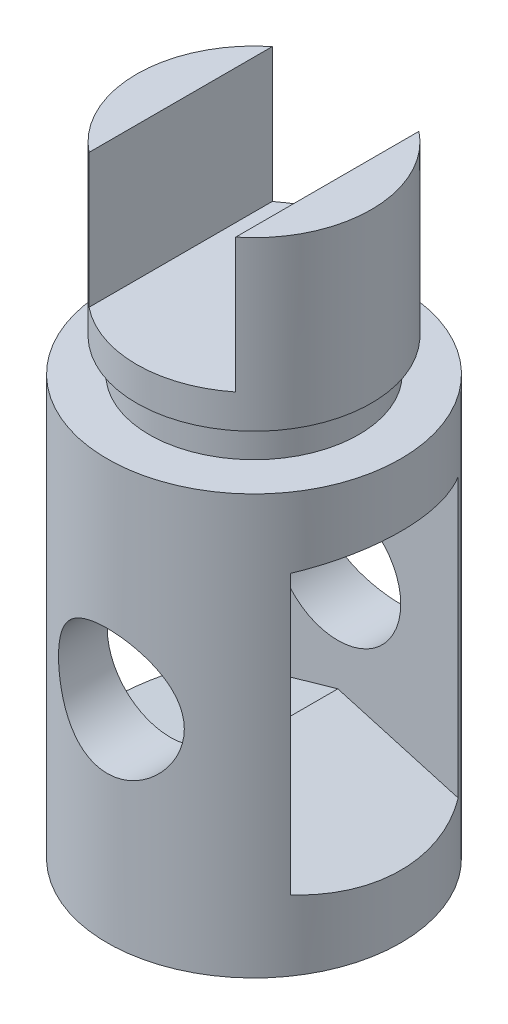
ISO-10303-21;
HEADER;
FILE_DESCRIPTION(('STEP AP214'),'2;1');
FILE_NAME('part.step','',(''),(''),'','','');
FILE_SCHEMA(('AUTOMOTIVE_DESIGN { 1 0 10303 214 1 1 1 1 }'));
ENDSEC;
DATA;
#1=APPLICATION_CONTEXT('core data for automotive mechanical design processes');
#2=APPLICATION_PROTOCOL_DEFINITION('international standard','automotive_design',2000,#1);
#3=PRODUCT_CONTEXT('',#1,'mechanical');
#4=PRODUCT('Part','Part','',(#3));
#5=PRODUCT_RELATED_PRODUCT_CATEGORY('part','',(#4));
#6=PRODUCT_DEFINITION_FORMATION('','',#4);
#7=PRODUCT_DEFINITION_CONTEXT('part definition',#1,'design');
#8=PRODUCT_DEFINITION('design','',#6,#7);
#9=PRODUCT_DEFINITION_SHAPE('','',#8);
#10=(LENGTH_UNIT() NAMED_UNIT(*) SI_UNIT(.MILLI.,.METRE.));
#11=(NAMED_UNIT(*) PLANE_ANGLE_UNIT() SI_UNIT($,.RADIAN.));
#12=(NAMED_UNIT(*) SI_UNIT($,.STERADIAN.) SOLID_ANGLE_UNIT());
#13=UNCERTAINTY_MEASURE_WITH_UNIT(LENGTH_MEASURE(1.E-05),#10,'distance_accuracy_value','');
#14=(GEOMETRIC_REPRESENTATION_CONTEXT(3) GLOBAL_UNCERTAINTY_ASSIGNED_CONTEXT((#13)) GLOBAL_UNIT_ASSIGNED_CONTEXT((#10,
#11,#12)) REPRESENTATION_CONTEXT('',''));
#15=CARTESIAN_POINT('',(0.,0.,0.));
#16=DIRECTION('',(0.,0.,1.));
#17=DIRECTION('',(1.,0.,0.));
#18=AXIS2_PLACEMENT_3D('',#15,#16,#17);
#19=CARTESIAN_POINT('',(-28.,98.,0.));
#20=DIRECTION('',(0.,1.,0.));
#21=DIRECTION('',(-1.,0.,0.));
#22=AXIS2_PLACEMENT_3D('',#19,#20,#21);
#23=PLANE('',#22);
#24=DIRECTION('',(0.,0.,1.));
#25=VECTOR('',#24,1.);
#26=CARTESIAN_POINT('',(-17.5,98.,0.));
#27=LINE('',#26,#25);
#28=CARTESIAN_POINT('',(-17.5,98.,-21.8574929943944));
#29=VERTEX_POINT('',#28);
#30=CARTESIAN_POINT('',(-17.5,98.,21.8574929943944));
#31=VERTEX_POINT('',#30);
#32=EDGE_CURVE('E114',#29,#31,#27,.T.);
#33=ORIENTED_EDGE('',*,*,#32,.F.);
#34=CARTESIAN_POINT('',(0.,98.,0.));
#35=DIRECTION('',(0.,1.,0.));
#36=DIRECTION('',(-1.,0.,0.));
#37=AXIS2_PLACEMENT_3D('',#34,#35,#36);
#38=CIRCLE('',#37,28.);
#39=EDGE_CURVE('E126',#29,#31,#38,.T.);
#40=ORIENTED_EDGE('',*,*,#39,.T.);
#41=EDGE_LOOP('',(#33,#40));
#42=FACE_BOUND('',#41,.T.);
#43=ADVANCED_FACE('F31',(#42),#23,.T.);
#44=CARTESIAN_POINT('',(0.,-50.,0.));
#45=DIRECTION('',(0.,-1.,0.));
#46=DIRECTION('',(1.,0.,0.));
#47=AXIS2_PLACEMENT_3D('',#44,#45,#46);
#48=PLANE('',#47);
#49=CARTESIAN_POINT('',(0.,-50.,0.));
#50=DIRECTION('',(0.,1.,0.));
#51=DIRECTION('',(-1.,0.,0.));
#52=AXIS2_PLACEMENT_3D('',#49,#50,#51);
#53=CIRCLE('',#52,35.);
#54=CARTESIAN_POINT('',(-35.,-50.,0.));
#55=VERTEX_POINT('',#54);
#56=EDGE_CURVE('E145',#55,#55,#53,.T.);
#57=ORIENTED_EDGE('',*,*,#56,.F.);
#58=EDGE_LOOP('',(#57));
#59=FACE_BOUND('',#58,.T.);
#60=ADVANCED_FACE('F33',(#59),#48,.T.);
#61=CARTESIAN_POINT('',(0.,98.,0.));
#62=DIRECTION('',(0.,1.,0.));
#63=DIRECTION('',(-1.,0.,0.));
#64=AXIS2_PLACEMENT_3D('',#61,#62,#63);
#65=CYLINDRICAL_SURFACE('',#64,35.);
#66=CARTESIAN_POINT('',(15.,0.,-31.6227766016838));
#67=CARTESIAN_POINT('',(14.9999969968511,-0.399001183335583,-31.6227798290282));
#68=CARTESIAN_POINT('',(14.9840568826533,-0.798130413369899,-31.6303543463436));
#69=CARTESIAN_POINT('',(14.9204623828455,-1.59346479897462,-31.660401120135));
#70=CARTESIAN_POINT('',(14.8727880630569,-1.98966795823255,-31.6828827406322));
#71=CARTESIAN_POINT('',(14.7461180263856,-2.77692441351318,-31.7420366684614));
#72=CARTESIAN_POINT('',(14.667048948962,-3.16796341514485,-31.7787422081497));
#73=CARTESIAN_POINT('',(14.47847300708,-3.94108363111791,-31.8650992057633));
#74=CARTESIAN_POINT('',(14.3689706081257,-4.3231661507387,-31.9147487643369));
#75=CARTESIAN_POINT('',(14.121142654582,-5.07435740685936,-32.025171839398));
#76=CARTESIAN_POINT('',(13.9829413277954,-5.44351429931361,-32.0858972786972));
#77=CARTESIAN_POINT('',(13.6786452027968,-6.16840331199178,-32.2167980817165));
#78=CARTESIAN_POINT('',(13.5125494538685,-6.52413497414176,-32.2869737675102));
#79=CARTESIAN_POINT('',(13.1538283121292,-7.22011098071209,-32.4347713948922));
#80=CARTESIAN_POINT('',(12.9612152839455,-7.56036244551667,-32.5123898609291));
#81=CARTESIAN_POINT('',(12.5506225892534,-8.22400096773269,-32.6730849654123));
#82=CARTESIAN_POINT('',(12.332633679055,-8.5473818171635,-32.7561635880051));
#83=CARTESIAN_POINT('',(11.8588991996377,-9.1943845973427,-32.9307449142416));
#84=CARTESIAN_POINT('',(11.6016771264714,-9.51687044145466,-33.022454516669));
#85=CARTESIAN_POINT('',(11.0617742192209,-10.1393747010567,-33.2072063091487));
#86=CARTESIAN_POINT('',(10.779092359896,-10.4393922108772,-33.3002485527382));
#87=CARTESIAN_POINT('',(10.189656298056,-11.0154808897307,-33.4853156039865));
#88=CARTESIAN_POINT('',(9.88288867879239,-11.2915385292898,-33.5773398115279));
#89=CARTESIAN_POINT('',(9.24715861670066,-11.8177948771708,-33.7579502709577));
#90=CARTESIAN_POINT('',(8.91820384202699,-12.0680024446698,-33.846537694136));
#91=CARTESIAN_POINT('',(8.22390793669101,-12.5520782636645,-34.0220726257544));
#92=CARTESIAN_POINT('',(7.85758519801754,-12.7846393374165,-34.1087507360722));
#93=CARTESIAN_POINT('',(7.10466659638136,-13.2178801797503,-34.2734912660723));
#94=CARTESIAN_POINT('',(6.71806992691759,-13.4185586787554,-34.3515533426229));
#95=CARTESIAN_POINT('',(5.9273163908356,-13.7861138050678,-34.4967887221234));
#96=CARTESIAN_POINT('',(5.5231659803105,-13.9530027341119,-34.5639659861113));
#97=CARTESIAN_POINT('',(4.70011703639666,-14.2513317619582,-34.6854707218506));
#98=CARTESIAN_POINT('',(4.28121960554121,-14.3827745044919,-34.739799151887));
#99=CARTESIAN_POINT('',(3.45520660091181,-14.60253703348,-34.8313748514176));
#100=CARTESIAN_POINT('',(3.04869879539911,-14.6928213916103,-34.8693935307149));
#101=CARTESIAN_POINT('',(2.22853652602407,-14.8393777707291,-34.9314000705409));
#102=CARTESIAN_POINT('',(1.8148823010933,-14.8956509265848,-34.9553883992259));
#103=CARTESIAN_POINT('',(0.983884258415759,-14.9735121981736,-34.9886385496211));
#104=CARTESIAN_POINT('',(0.566541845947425,-14.9951129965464,-34.9979057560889));
#105=CARTESIAN_POINT('',(-0.268545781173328,-15.0034069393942,-35.0014599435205));
#106=CARTESIAN_POINT('',(-0.686290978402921,-14.9901015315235,-34.9957475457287));
#107=CARTESIAN_POINT('',(-1.49190758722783,-14.9307301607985,-34.9703596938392));
#108=CARTESIAN_POINT('',(-1.87997004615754,-14.8868295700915,-34.9516073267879));
#109=CARTESIAN_POINT('',(-2.65068752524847,-14.7690828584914,-34.9016183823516));
#110=CARTESIAN_POINT('',(-3.03334282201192,-14.6952382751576,-34.8703824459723));
#111=CARTESIAN_POINT('',(-3.79067999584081,-14.5183324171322,-34.7962000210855));
#112=CARTESIAN_POINT('',(-4.16536159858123,-14.4152701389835,-34.7532531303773));
#113=CARTESIAN_POINT('',(-4.90436245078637,-14.180885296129,-34.656689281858));
#114=CARTESIAN_POINT('',(-5.26868138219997,-14.0495618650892,-34.6030719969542));
#115=CARTESIAN_POINT('',(-5.99025205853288,-13.7575676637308,-34.4855410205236));
#116=CARTESIAN_POINT('',(-6.34731135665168,-13.5964799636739,-34.4214828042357));
#117=CARTESIAN_POINT('',(-7.04650073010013,-13.2476217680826,-34.2851820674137));
#118=CARTESIAN_POINT('',(-7.38863077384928,-13.0598512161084,-34.212939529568));
#119=CARTESIAN_POINT('',(-8.05621899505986,-12.6589476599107,-34.0619212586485));
#120=CARTESIAN_POINT('',(-8.38167533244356,-12.4458118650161,-33.9831448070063));
#121=CARTESIAN_POINT('',(-9.01440333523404,-11.9954738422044,-33.8208111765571));
#122=CARTESIAN_POINT('',(-9.32166787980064,-11.7582622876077,-33.7372521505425));
#123=CARTESIAN_POINT('',(-9.93840787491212,-11.2428311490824,-33.5609647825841));
#124=CARTESIAN_POINT('',(-10.2463720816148,-10.9628770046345,-33.4680149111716));
#125=CARTESIAN_POINT('',(-10.8378576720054,-10.3785206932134,-33.2811817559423));
#126=CARTESIAN_POINT('',(-11.1213782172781,-10.0741176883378,-33.1872984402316));
#127=CARTESIAN_POINT('',(-11.6624805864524,-9.4424336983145,-33.0010372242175));
#128=CARTESIAN_POINT('',(-11.9200531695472,-9.11514463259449,-32.9086598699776));
#129=CARTESIAN_POINT('',(-12.4076070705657,-8.43948288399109,-32.7279529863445));
#130=CARTESIAN_POINT('',(-12.6375841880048,-8.09110700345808,-32.6396240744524));
#131=CARTESIAN_POINT('',(-13.0762496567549,-7.36201511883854,-32.4664341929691));
#132=CARTESIAN_POINT('',(-13.2838446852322,-6.98058105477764,-32.3818200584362));
#133=CARTESIAN_POINT('',(-13.6657796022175,-6.19962193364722,-32.2224967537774));
#134=CARTESIAN_POINT('',(-13.840134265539,-5.80010501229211,-32.1477831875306));
#135=CARTESIAN_POINT('',(-14.1539223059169,-4.98566323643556,-32.0108701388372));
#136=CARTESIAN_POINT('',(-14.2933691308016,-4.57074438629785,-31.9486658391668));
#137=CARTESIAN_POINT('',(-14.53583039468,-3.72848779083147,-31.8390857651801));
#138=CARTESIAN_POINT('',(-14.6388483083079,-3.30115123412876,-31.7917085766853));
#139=CARTESIAN_POINT('',(-14.8014667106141,-2.46675388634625,-31.7163058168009));
#140=CARTESIAN_POINT('',(-14.8635274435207,-2.06027019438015,-31.6871903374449));
#141=CARTESIAN_POINT('',(-14.9540838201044,-1.24276757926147,-31.6445557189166));
#142=CARTESIAN_POINT('',(-14.9825809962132,-0.831748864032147,-31.6310358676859));
#143=CARTESIAN_POINT('',(-15.0056445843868,-0.00868348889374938,-31.620101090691));
#144=CARTESIAN_POINT('',(-15.0002221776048,0.403362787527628,-31.6226808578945));
#145=CARTESIAN_POINT('',(-14.9555420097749,1.22519238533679,-31.6438362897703));
#146=CARTESIAN_POINT('',(-14.9162853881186,1.634975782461,-31.6624114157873));
#147=CARTESIAN_POINT('',(-14.8083348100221,2.42060869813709,-31.7130331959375));
#148=CARTESIAN_POINT('',(-14.7418793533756,2.7968352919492,-31.7440524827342));
#149=CARTESIAN_POINT('',(-14.5808056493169,3.54194568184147,-31.8183589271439));
#150=CARTESIAN_POINT('',(-14.486188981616,3.91082988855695,-31.8616453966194));
#151=CARTESIAN_POINT('',(-14.2696869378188,4.63900052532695,-31.9591944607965));
#152=CARTESIAN_POINT('',(-14.1478014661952,4.99828692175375,-32.0134570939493));
#153=CARTESIAN_POINT('',(-13.8777487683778,5.70538226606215,-32.1314455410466));
#154=CARTESIAN_POINT('',(-13.7295712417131,6.05318665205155,-32.1951750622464));
#155=CARTESIAN_POINT('',(-13.4011569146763,6.75008844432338,-32.3332965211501));
#156=CARTESIAN_POINT('',(-13.2198147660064,7.09859720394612,-32.4080293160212));
#157=CARTESIAN_POINT('',(-12.8310033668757,7.7794024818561,-32.563925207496));
#158=CARTESIAN_POINT('',(-12.6235226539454,8.11169179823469,-32.6450911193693));
#159=CARTESIAN_POINT('',(-12.183761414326,8.7583602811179,-32.811754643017));
#160=CARTESIAN_POINT('',(-11.9514768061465,9.07273648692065,-32.8972529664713));
#161=CARTESIAN_POINT('',(-11.4634289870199,9.68205454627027,-33.0704829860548));
#162=CARTESIAN_POINT('',(-11.2076646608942,9.97699547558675,-33.1582147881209));
#163=CARTESIAN_POINT('',(-10.6506249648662,10.5709079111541,-33.3415278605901));
#164=CARTESIAN_POINT('',(-10.3473256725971,10.8679799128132,-33.4371252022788));
#165=CARTESIAN_POINT('',(-9.71633909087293,11.4355928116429,-33.6259000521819));
#166=CARTESIAN_POINT('',(-9.38865995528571,11.706142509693,-33.7190783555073));
#167=CARTESIAN_POINT('',(-8.71053874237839,12.2191371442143,-33.9005859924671));
#168=CARTESIAN_POINT('',(-8.36008927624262,12.4615728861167,-33.9889137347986));
#169=CARTESIAN_POINT('',(-7.6385557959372,12.9164364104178,-34.1583045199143));
#170=CARTESIAN_POINT('',(-7.26747222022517,13.1288648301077,-34.2393677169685));
#171=CARTESIAN_POINT('',(-6.50504044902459,13.5229249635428,-34.392388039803));
#172=CARTESIAN_POINT('',(-6.11360008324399,13.7043971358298,-34.4642975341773));
#173=CARTESIAN_POINT('',(-5.31481805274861,14.0335057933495,-34.5964819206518));
#174=CARTESIAN_POINT('',(-4.90747616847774,14.1811418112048,-34.6567566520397));
#175=CARTESIAN_POINT('',(-4.0801280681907,14.4409295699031,-34.7638668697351));
#176=CARTESIAN_POINT('',(-3.66012856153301,14.5530997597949,-34.8107093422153));
#177=CARTESIAN_POINT('',(-2.81065056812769,14.7407394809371,-34.8895705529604));
#178=CARTESIAN_POINT('',(-2.38117284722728,14.8162119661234,-34.9215904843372));
#179=CARTESIAN_POINT('',(-1.54810458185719,14.9253716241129,-34.9680494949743));
#180=CARTESIAN_POINT('',(-1.14492225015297,14.9617146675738,-34.9836045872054));
#181=CARTESIAN_POINT('',(-0.336650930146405,15.0016786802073,-35.0007146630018));
#182=CARTESIAN_POINT('',(0.0684379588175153,15.0053013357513,-35.0022703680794));
#183=CARTESIAN_POINT('',(0.877316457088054,14.9797874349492,-34.9913404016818));
#184=CARTESIAN_POINT('',(1.28110627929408,14.9506565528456,-34.9788571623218));
#185=CARTESIAN_POINT('',(2.08435932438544,14.8599731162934,-34.9401934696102));
#186=CARTESIAN_POINT('',(2.48382258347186,14.7984208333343,-34.9140131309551));
#187=CARTESIAN_POINT('',(3.25990951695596,14.6466091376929,-34.8499444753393));
#188=CARTESIAN_POINT('',(3.63681443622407,14.5575705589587,-34.812555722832));
#189=CARTESIAN_POINT('',(4.38142946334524,14.3510400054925,-34.7266976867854));
#190=CARTESIAN_POINT('',(4.74913989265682,14.2335490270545,-34.6782287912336));
#191=CARTESIAN_POINT('',(5.47318347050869,13.9711332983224,-34.5713495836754));
#192=CARTESIAN_POINT('',(5.82951524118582,13.8262052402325,-34.5129380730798));
#193=CARTESIAN_POINT('',(6.52876162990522,13.5100891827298,-34.3875190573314));
#194=CARTESIAN_POINT('',(6.87167568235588,13.3389000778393,-34.3205111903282));
#195=CARTESIAN_POINT('',(7.55759351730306,12.9631244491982,-34.1761780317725));
#196=CARTESIAN_POINT('',(7.89988828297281,12.7573709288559,-34.0985215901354));
#197=CARTESIAN_POINT('',(8.56603740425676,12.3199752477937,-33.9373019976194));
#198=CARTESIAN_POINT('',(8.88989132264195,12.0883324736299,-33.8537387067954));
#199=CARTESIAN_POINT('',(9.51757199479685,11.6005951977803,-33.6826610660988));
#200=CARTESIAN_POINT('',(9.82139648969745,11.3444979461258,-33.5951462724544));
#201=CARTESIAN_POINT('',(10.4076237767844,10.8092091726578,-33.4181862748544));
#202=CARTESIAN_POINT('',(10.690016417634,10.5300068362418,-33.3287401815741));
#203=CARTESIAN_POINT('',(11.2515403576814,9.92895006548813,-33.1435737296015));
#204=CARTESIAN_POINT('',(11.5289405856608,9.60547042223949,-33.0478701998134));
#205=CARTESIAN_POINT('',(12.0554848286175,8.93569669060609,-32.8594501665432));
#206=CARTESIAN_POINT('',(12.3046407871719,8.58941234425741,-32.7667324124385));
#207=CARTESIAN_POINT('',(12.7733627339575,7.87551217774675,-32.586872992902));
#208=CARTESIAN_POINT('',(12.9929022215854,7.50787766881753,-32.4997363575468));
#209=CARTESIAN_POINT('',(13.4004122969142,6.75371231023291,-32.3338425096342));
#210=CARTESIAN_POINT('',(13.5883850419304,6.36718275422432,-32.2550847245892));
#211=CARTESIAN_POINT('',(13.9307889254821,5.57832120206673,-32.1086866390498));
#212=CARTESIAN_POINT('',(14.0852785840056,5.17601825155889,-32.0410269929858));
#213=CARTESIAN_POINT('',(14.3595587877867,4.35767079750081,-31.9190482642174));
#214=CARTESIAN_POINT('',(14.4793432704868,3.9416239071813,-31.8647315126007));
#215=CARTESIAN_POINT('',(14.6824564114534,3.10035314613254,-31.7716530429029));
#216=CARTESIAN_POINT('',(14.7658930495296,2.67516044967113,-31.7328452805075));
#217=CARTESIAN_POINT('',(14.8956958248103,1.81818415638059,-31.6721241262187));
#218=CARTESIAN_POINT('',(14.9420903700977,1.38640586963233,-31.6501977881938));
#219=CARTESIAN_POINT('',(14.9797789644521,0.794693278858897,-31.6323614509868));
#220=CARTESIAN_POINT('',(14.9873593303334,0.635879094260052,-31.6287699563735));
#221=CARTESIAN_POINT('',(14.9974704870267,0.318050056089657,-31.6239768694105));
#222=CARTESIAN_POINT('',(15.0000011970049,0.159035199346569,-31.6227753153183));
#223=CARTESIAN_POINT('',(15.,0.,-31.6227766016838));
#224=B_SPLINE_CURVE_WITH_KNOTS('',3,(#66,#67,#68,#69,#70,#71,#72,#73,#74,#75,#76,#77,#78,#79,
#80,#81,#82,#83,#84,#85,#86,#87,#88,#89,#90,#91,#92,#93,#94,#95,#96,#97,#98,#99,#100,#101,#102,
#103,#104,#105,#106,#107,#108,#109,#110,#111,#112,#113,#114,#115,#116,#117,#118,#119,#120,#121,
#122,#123,#124,#125,#126,#127,#128,#129,#130,#131,#132,#133,#134,#135,#136,#137,#138,#139,#140,
#141,#142,#143,#144,#145,#146,#147,#148,#149,#150,#151,#152,#153,#154,#155,#156,#157,#158,#159,
#160,#161,#162,#163,#164,#165,#166,#167,#168,#169,#170,#171,#172,#173,#174,#175,#176,#177,#178,
#179,#180,#181,#182,#183,#184,#185,#186,#187,#188,#189,#190,#191,#192,#193,#194,#195,#196,#197,
#198,#199,#200,#201,#202,#203,#204,#205,#206,#207,#208,#209,#210,#211,#212,#213,#214,#215,#216,
#217,#218,#219,#220,#221,#222,#223),.UNSPECIFIED.,.T.,.F.,(4,2,2,2,2,2,2,2,2,2,2,2,2,2,2,2,2,2,
2,2,2,2,2,2,2,2,2,2,2,2,2,2,2,2,2,2,2,2,2,2,2,2,2,2,2,2,2,2,2,2,2,2,2,2,2,2,2,2,2,2,2,2,2,2,2,2,
2,2,2,2,2,2,2,2,2,2,2,2,4),(0.,1.1968382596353,2.39442903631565,3.59483486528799,
4.79506465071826,5.99020348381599,7.18538305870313,8.38000721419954,9.57506790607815,
10.8414089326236,12.1078009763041,13.3749035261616,14.6415703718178,15.9673413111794,
17.2931650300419,18.6185051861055,19.9437464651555,21.1965415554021,22.4492948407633,
23.7015897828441,24.9538327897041,26.1254164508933,27.2969399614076,28.4685037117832,
29.6401033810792,30.82956641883,32.0190319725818,33.2086285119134,34.3986876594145,
35.6765982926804,36.9545527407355,38.2329607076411,39.5115630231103,40.8371660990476,
42.1621785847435,43.4866798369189,44.8110547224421,46.0460817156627,47.2810523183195,
48.5156158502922,49.7501378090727,50.8987548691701,52.0473075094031,53.1958641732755,
54.3448718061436,55.5433331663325,56.7423219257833,57.9415082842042,59.1407516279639,
60.4447784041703,61.7483709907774,63.0523887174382,64.3563787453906,65.6668985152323,
66.9774363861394,68.2872913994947,69.5970409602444,70.8108492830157,72.0245950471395,
73.238130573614,74.4516559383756,75.6175774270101,76.783458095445,77.949479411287,
79.1155498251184,80.33479554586,81.5540701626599,82.7734820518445,83.9934679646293,
85.3021866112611,86.6103497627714,87.9196757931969,89.228912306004,90.5358418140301,
91.8429994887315,93.146247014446,94.4484940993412,94.9255261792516,95.4025658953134),.UNSPECIFIED.);
#225=CARTESIAN_POINT('',(15.,0.,-31.6227766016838));
#226=VERTEX_POINT('',#225);
#227=EDGE_CURVE('E195',#226,#226,#224,.T.);
#228=ORIENTED_EDGE('',*,*,#227,.F.);
#229=EDGE_LOOP('',(#228));
#230=FACE_BOUND('',#229,.T.);
#231=CARTESIAN_POINT('',(15.,0.,31.6227766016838));
#232=CARTESIAN_POINT('',(14.9999969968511,0.399001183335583,31.6227798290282));
#233=CARTESIAN_POINT('',(14.9840568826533,0.798130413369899,31.6303543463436));
#234=CARTESIAN_POINT('',(14.9204623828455,1.59346479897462,31.660401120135));
#235=CARTESIAN_POINT('',(14.8727880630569,1.98966795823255,31.6828827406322));
#236=CARTESIAN_POINT('',(14.7461180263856,2.77692441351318,31.7420366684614));
#237=CARTESIAN_POINT('',(14.667048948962,3.16796341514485,31.7787422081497));
#238=CARTESIAN_POINT('',(14.47847300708,3.94108363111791,31.8650992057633));
#239=CARTESIAN_POINT('',(14.3689706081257,4.3231661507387,31.9147487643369));
#240=CARTESIAN_POINT('',(14.121142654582,5.07435740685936,32.025171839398));
#241=CARTESIAN_POINT('',(13.9829413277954,5.44351429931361,32.0858972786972));
#242=CARTESIAN_POINT('',(13.6786452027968,6.16840331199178,32.2167980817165));
#243=CARTESIAN_POINT('',(13.5125494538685,6.52413497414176,32.2869737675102));
#244=CARTESIAN_POINT('',(13.1538283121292,7.22011098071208,32.4347713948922));
#245=CARTESIAN_POINT('',(12.9612152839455,7.56036244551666,32.5123898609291));
#246=CARTESIAN_POINT('',(12.5506225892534,8.22400096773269,32.6730849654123));
#247=CARTESIAN_POINT('',(12.332633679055,8.5473818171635,32.7561635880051));
#248=CARTESIAN_POINT('',(11.8588991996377,9.1943845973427,32.9307449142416));
#249=CARTESIAN_POINT('',(11.6016771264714,9.51687044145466,33.022454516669));
#250=CARTESIAN_POINT('',(11.0617742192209,10.1393747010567,33.2072063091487));
#251=CARTESIAN_POINT('',(10.779092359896,10.4393922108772,33.3002485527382));
#252=CARTESIAN_POINT('',(10.189656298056,11.0154808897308,33.4853156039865));
#253=CARTESIAN_POINT('',(9.88288867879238,11.2915385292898,33.5773398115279));
#254=CARTESIAN_POINT('',(9.24715861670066,11.8177948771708,33.7579502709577));
#255=CARTESIAN_POINT('',(8.91820384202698,12.0680024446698,33.846537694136));
#256=CARTESIAN_POINT('',(8.22390793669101,12.5520782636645,34.0220726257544));
#257=CARTESIAN_POINT('',(7.85758519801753,12.7846393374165,34.1087507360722));
#258=CARTESIAN_POINT('',(7.10466659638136,13.2178801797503,34.2734912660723));
#259=CARTESIAN_POINT('',(6.71806992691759,13.4185586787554,34.3515533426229));
#260=CARTESIAN_POINT('',(5.9273163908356,13.7861138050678,34.4967887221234));
#261=CARTESIAN_POINT('',(5.5231659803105,13.9530027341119,34.5639659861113));
#262=CARTESIAN_POINT('',(4.70011703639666,14.2513317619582,34.6854707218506));
#263=CARTESIAN_POINT('',(4.2812196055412,14.3827745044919,34.739799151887));
#264=CARTESIAN_POINT('',(3.45520660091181,14.60253703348,34.8313748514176));
#265=CARTESIAN_POINT('',(3.04869879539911,14.6928213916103,34.8693935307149));
#266=CARTESIAN_POINT('',(2.22853652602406,14.8393777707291,34.9314000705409));
#267=CARTESIAN_POINT('',(1.8148823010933,14.8956509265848,34.9553883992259));
#268=CARTESIAN_POINT('',(0.983884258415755,14.9735121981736,34.9886385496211));
#269=CARTESIAN_POINT('',(0.56654184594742,14.9951129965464,34.9979057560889));
#270=CARTESIAN_POINT('',(-0.268545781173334,15.0034069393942,35.0014599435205));
#271=CARTESIAN_POINT('',(-0.686290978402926,14.9901015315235,34.9957475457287));
#272=CARTESIAN_POINT('',(-1.49190758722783,14.9307301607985,34.9703596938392));
#273=CARTESIAN_POINT('',(-1.87997004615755,14.8868295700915,34.9516073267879));
#274=CARTESIAN_POINT('',(-2.65068752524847,14.7690828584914,34.9016183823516));
#275=CARTESIAN_POINT('',(-3.03334282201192,14.6952382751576,34.8703824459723));
#276=CARTESIAN_POINT('',(-3.79067999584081,14.5183324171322,34.7962000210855));
#277=CARTESIAN_POINT('',(-4.16536159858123,14.4152701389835,34.7532531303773));
#278=CARTESIAN_POINT('',(-4.90436245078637,14.180885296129,34.656689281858));
#279=CARTESIAN_POINT('',(-5.26868138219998,14.0495618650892,34.6030719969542));
#280=CARTESIAN_POINT('',(-5.99025205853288,13.7575676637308,34.4855410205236));
#281=CARTESIAN_POINT('',(-6.34731135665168,13.5964799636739,34.4214828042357));
#282=CARTESIAN_POINT('',(-7.04650073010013,13.2476217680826,34.2851820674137));
#283=CARTESIAN_POINT('',(-7.38863077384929,13.0598512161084,34.212939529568));
#284=CARTESIAN_POINT('',(-8.05621899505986,12.6589476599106,34.0619212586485));
#285=CARTESIAN_POINT('',(-8.38167533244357,12.4458118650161,33.9831448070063));
#286=CARTESIAN_POINT('',(-9.01440333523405,11.9954738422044,33.8208111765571));
#287=CARTESIAN_POINT('',(-9.32166787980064,11.7582622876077,33.7372521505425));
#288=CARTESIAN_POINT('',(-9.93840787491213,11.2428311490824,33.5609647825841));
#289=CARTESIAN_POINT('',(-10.2463720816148,10.9628770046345,33.4680149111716));
#290=CARTESIAN_POINT('',(-10.8378576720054,10.3785206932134,33.2811817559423));
#291=CARTESIAN_POINT('',(-11.1213782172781,10.0741176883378,33.1872984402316));
#292=CARTESIAN_POINT('',(-11.6624805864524,9.44243369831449,33.0010372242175));
#293=CARTESIAN_POINT('',(-11.9200531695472,9.11514463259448,32.9086598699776));
#294=CARTESIAN_POINT('',(-12.4076070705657,8.43948288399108,32.7279529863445));
#295=CARTESIAN_POINT('',(-12.6375841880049,8.09110700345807,32.6396240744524));
#296=CARTESIAN_POINT('',(-13.0762496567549,7.36201511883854,32.4664341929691));
#297=CARTESIAN_POINT('',(-13.2838446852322,6.98058105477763,32.3818200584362));
#298=CARTESIAN_POINT('',(-13.6657796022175,6.19962193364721,32.2224967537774));
#299=CARTESIAN_POINT('',(-13.840134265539,5.80010501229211,32.1477831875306));
#300=CARTESIAN_POINT('',(-14.1539223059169,4.98566323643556,32.0108701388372));
#301=CARTESIAN_POINT('',(-14.2933691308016,4.57074438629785,31.9486658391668));
#302=CARTESIAN_POINT('',(-14.53583039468,3.72848779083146,31.8390857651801));
#303=CARTESIAN_POINT('',(-14.6388483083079,3.30115123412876,31.7917085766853));
#304=CARTESIAN_POINT('',(-14.8014667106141,2.46675388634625,31.7163058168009));
#305=CARTESIAN_POINT('',(-14.8635274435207,2.06027019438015,31.6871903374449));
#306=CARTESIAN_POINT('',(-14.9540838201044,1.24276757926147,31.6445557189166));
#307=CARTESIAN_POINT('',(-14.9825809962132,0.831748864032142,31.6310358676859));
#308=CARTESIAN_POINT('',(-15.0056445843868,0.00868348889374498,31.620101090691));
#309=CARTESIAN_POINT('',(-15.0002221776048,-0.403362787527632,31.6226808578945));
#310=CARTESIAN_POINT('',(-14.9555420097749,-1.2251923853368,31.6438362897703));
#311=CARTESIAN_POINT('',(-14.9162853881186,-1.634975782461,31.6624114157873));
#312=CARTESIAN_POINT('',(-14.8083348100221,-2.4206086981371,31.7130331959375));
#313=CARTESIAN_POINT('',(-14.7418793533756,-2.7968352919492,31.7440524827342));
#314=CARTESIAN_POINT('',(-14.5808056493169,-3.54194568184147,31.8183589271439));
#315=CARTESIAN_POINT('',(-14.486188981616,-3.91082988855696,31.8616453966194));
#316=CARTESIAN_POINT('',(-14.2696869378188,-4.63900052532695,31.9591944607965));
#317=CARTESIAN_POINT('',(-14.1478014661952,-4.99828692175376,32.0134570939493));
#318=CARTESIAN_POINT('',(-13.8777487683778,-5.70538226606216,32.1314455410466));
#319=CARTESIAN_POINT('',(-13.7295712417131,-6.05318665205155,32.1951750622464));
#320=CARTESIAN_POINT('',(-13.4011569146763,-6.75008844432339,32.3332965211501));
#321=CARTESIAN_POINT('',(-13.2198147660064,-7.09859720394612,32.4080293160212));
#322=CARTESIAN_POINT('',(-12.8310033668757,-7.77940248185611,32.563925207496));
#323=CARTESIAN_POINT('',(-12.6235226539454,-8.1116917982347,32.6450911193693));
#324=CARTESIAN_POINT('',(-12.183761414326,-8.7583602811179,32.811754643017));
#325=CARTESIAN_POINT('',(-11.9514768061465,-9.07273648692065,32.8972529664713));
#326=CARTESIAN_POINT('',(-11.4634289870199,-9.68205454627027,33.0704829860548));
#327=CARTESIAN_POINT('',(-11.2076646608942,-9.97699547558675,33.1582147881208));
#328=CARTESIAN_POINT('',(-10.6506249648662,-10.5709079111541,33.3415278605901));
#329=CARTESIAN_POINT('',(-10.3473256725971,-10.8679799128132,33.4371252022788));
#330=CARTESIAN_POINT('',(-9.71633909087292,-11.4355928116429,33.6259000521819));
#331=CARTESIAN_POINT('',(-9.38865995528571,-11.706142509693,33.7190783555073));
#332=CARTESIAN_POINT('',(-8.71053874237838,-12.2191371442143,33.9005859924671));
#333=CARTESIAN_POINT('',(-8.36008927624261,-12.4615728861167,33.9889137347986));
#334=CARTESIAN_POINT('',(-7.63855579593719,-12.9164364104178,34.1583045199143));
#335=CARTESIAN_POINT('',(-7.26747222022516,-13.1288648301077,34.2393677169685));
#336=CARTESIAN_POINT('',(-6.50504044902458,-13.5229249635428,34.392388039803));
#337=CARTESIAN_POINT('',(-6.11360008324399,-13.7043971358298,34.4642975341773));
#338=CARTESIAN_POINT('',(-5.3148180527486,-14.0335057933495,34.5964819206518));
#339=CARTESIAN_POINT('',(-4.90747616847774,-14.1811418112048,34.6567566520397));
#340=CARTESIAN_POINT('',(-4.08012806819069,-14.4409295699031,34.7638668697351));
#341=CARTESIAN_POINT('',(-3.660128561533,-14.5530997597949,34.8107093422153));
#342=CARTESIAN_POINT('',(-2.81065056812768,-14.7407394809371,34.8895705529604));
#343=CARTESIAN_POINT('',(-2.38117284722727,-14.8162119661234,34.9215904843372));
#344=CARTESIAN_POINT('',(-1.54810458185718,-14.9253716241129,34.9680494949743));
#345=CARTESIAN_POINT('',(-1.14492225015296,-14.9617146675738,34.9836045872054));
#346=CARTESIAN_POINT('',(-0.336650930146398,-15.0016786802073,35.0007146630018));
#347=CARTESIAN_POINT('',(0.0684379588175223,-15.0053013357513,35.0022703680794));
#348=CARTESIAN_POINT('',(0.87731645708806,-14.9797874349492,34.9913404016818));
#349=CARTESIAN_POINT('',(1.28110627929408,-14.9506565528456,34.9788571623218));
#350=CARTESIAN_POINT('',(2.08435932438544,-14.8599731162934,34.9401934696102));
#351=CARTESIAN_POINT('',(2.48382258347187,-14.7984208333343,34.9140131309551));
#352=CARTESIAN_POINT('',(3.25990951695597,-14.6466091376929,34.8499444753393));
#353=CARTESIAN_POINT('',(3.63681443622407,-14.5575705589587,34.812555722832));
#354=CARTESIAN_POINT('',(4.38142946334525,-14.3510400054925,34.7266976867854));
#355=CARTESIAN_POINT('',(4.74913989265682,-14.2335490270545,34.6782287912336));
#356=CARTESIAN_POINT('',(5.4731834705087,-13.9711332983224,34.5713495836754));
#357=CARTESIAN_POINT('',(5.82951524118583,-13.8262052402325,34.5129380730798));
#358=CARTESIAN_POINT('',(6.52876162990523,-13.5100891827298,34.3875190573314));
#359=CARTESIAN_POINT('',(6.87167568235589,-13.3389000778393,34.3205111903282));
#360=CARTESIAN_POINT('',(7.55759351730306,-12.9631244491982,34.1761780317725));
#361=CARTESIAN_POINT('',(7.89988828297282,-12.7573709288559,34.0985215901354));
#362=CARTESIAN_POINT('',(8.56603740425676,-12.3199752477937,33.9373019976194));
#363=CARTESIAN_POINT('',(8.88989132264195,-12.0883324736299,33.8537387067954));
#364=CARTESIAN_POINT('',(9.51757199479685,-11.6005951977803,33.6826610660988));
#365=CARTESIAN_POINT('',(9.82139648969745,-11.3444979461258,33.5951462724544));
#366=CARTESIAN_POINT('',(10.4076237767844,-10.8092091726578,33.4181862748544));
#367=CARTESIAN_POINT('',(10.690016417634,-10.5300068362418,33.3287401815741));
#368=CARTESIAN_POINT('',(11.2515403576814,-9.92895006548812,33.1435737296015));
#369=CARTESIAN_POINT('',(11.5289405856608,-9.60547042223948,33.0478701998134));
#370=CARTESIAN_POINT('',(12.0554848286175,-8.93569669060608,32.8594501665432));
#371=CARTESIAN_POINT('',(12.3046407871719,-8.5894123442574,32.7667324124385));
#372=CARTESIAN_POINT('',(12.7733627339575,-7.87551217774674,32.586872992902));
#373=CARTESIAN_POINT('',(12.9929022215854,-7.50787766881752,32.4997363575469));
#374=CARTESIAN_POINT('',(13.4004122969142,-6.7537123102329,32.3338425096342));
#375=CARTESIAN_POINT('',(13.5883850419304,-6.36718275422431,32.2550847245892));
#376=CARTESIAN_POINT('',(13.9307889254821,-5.57832120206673,32.1086866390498));
#377=CARTESIAN_POINT('',(14.0852785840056,-5.17601825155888,32.0410269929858));
#378=CARTESIAN_POINT('',(14.3595587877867,-4.3576707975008,31.9190482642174));
#379=CARTESIAN_POINT('',(14.4793432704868,-3.94162390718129,31.8647315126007));
#380=CARTESIAN_POINT('',(14.6824564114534,-3.10035314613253,31.7716530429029));
#381=CARTESIAN_POINT('',(14.7658930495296,-2.67516044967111,31.7328452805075));
#382=CARTESIAN_POINT('',(14.8956958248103,-1.81818415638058,31.6721241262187));
#383=CARTESIAN_POINT('',(14.9420903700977,-1.38640586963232,31.6501977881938));
#384=CARTESIAN_POINT('',(14.9797789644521,-0.794693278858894,31.6323614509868));
#385=CARTESIAN_POINT('',(14.9873593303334,-0.63587909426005,31.6287699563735));
#386=CARTESIAN_POINT('',(14.9974704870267,-0.318050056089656,31.6239768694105));
#387=CARTESIAN_POINT('',(15.0000011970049,-0.159035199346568,31.6227753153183));
#388=CARTESIAN_POINT('',(15.,0.,31.6227766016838));
#389=B_SPLINE_CURVE_WITH_KNOTS('',3,(#231,#232,#233,#234,#235,#236,#237,#238,#239,#240,#241,
#242,#243,#244,#245,#246,#247,#248,#249,#250,#251,#252,#253,#254,#255,#256,#257,#258,#259,#260,
#261,#262,#263,#264,#265,#266,#267,#268,#269,#270,#271,#272,#273,#274,#275,#276,#277,#278,#279,
#280,#281,#282,#283,#284,#285,#286,#287,#288,#289,#290,#291,#292,#293,#294,#295,#296,#297,#298,
#299,#300,#301,#302,#303,#304,#305,#306,#307,#308,#309,#310,#311,#312,#313,#314,#315,#316,#317,
#318,#319,#320,#321,#322,#323,#324,#325,#326,#327,#328,#329,#330,#331,#332,#333,#334,#335,#336,
#337,#338,#339,#340,#341,#342,#343,#344,#345,#346,#347,#348,#349,#350,#351,#352,#353,#354,#355,
#356,#357,#358,#359,#360,#361,#362,#363,#364,#365,#366,#367,#368,#369,#370,#371,#372,#373,#374,
#375,#376,#377,#378,#379,#380,#381,#382,#383,#384,#385,#386,#387,#388),.UNSPECIFIED.,.T.,.F.,(4,
2,2,2,2,2,2,2,2,2,2,2,2,2,2,2,2,2,2,2,2,2,2,2,2,2,2,2,2,2,2,2,2,2,2,2,2,2,2,2,2,2,2,2,2,2,2,2,2,
2,2,2,2,2,2,2,2,2,2,2,2,2,2,2,2,2,2,2,2,2,2,2,2,2,2,2,2,2,4),(0.,1.1968382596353,
2.39442903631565,3.59483486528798,4.79506465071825,5.99020348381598,7.18538305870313,
8.38000721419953,9.57506790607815,10.8414089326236,12.1078009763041,13.3749035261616,
14.6415703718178,15.9673413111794,17.2931650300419,18.6185051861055,19.9437464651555,
21.1965415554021,22.4492948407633,23.7015897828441,24.9538327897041,26.1254164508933,
27.2969399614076,28.4685037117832,29.6401033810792,30.8295664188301,32.0190319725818,
33.2086285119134,34.3986876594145,35.6765982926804,36.9545527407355,38.2329607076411,
39.5115630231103,40.8371660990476,42.1621785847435,43.4866798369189,44.8110547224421,
46.0460817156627,47.2810523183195,48.5156158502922,49.7501378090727,50.8987548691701,
52.0473075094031,53.1958641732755,54.3448718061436,55.5433331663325,56.7423219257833,
57.9415082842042,59.1407516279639,60.4447784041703,61.7483709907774,63.0523887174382,
64.3563787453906,65.6668985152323,66.9774363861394,68.2872913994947,69.5970409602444,
70.8108492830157,72.0245950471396,73.2381305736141,74.4516559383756,75.6175774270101,
76.783458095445,77.949479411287,79.1155498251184,80.3347955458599,81.5540701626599,
82.7734820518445,83.9934679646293,85.3021866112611,86.6103497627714,87.9196757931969,
89.228912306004,90.5358418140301,91.8429994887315,93.146247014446,94.4484940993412,
94.9255261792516,95.4025658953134),.UNSPECIFIED.);
#390=CARTESIAN_POINT('',(15.,0.,31.6227766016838));
#391=VERTEX_POINT('',#390);
#392=EDGE_CURVE('E189',#391,#391,#389,.T.);
#393=ORIENTED_EDGE('',*,*,#392,.F.);
#394=EDGE_LOOP('',(#393));
#395=FACE_BOUND('',#394,.T.);
#396=DIRECTION('',(0.,1.,0.));
#397=VECTOR('',#396,1.);
#398=CARTESIAN_POINT('',(-28.7228132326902,98.,-20.));
#399=LINE('',#398,#397);
#400=CARTESIAN_POINT('',(-28.7228132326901,33.2065180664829,-20.));
#401=VERTEX_POINT('',#400);
#402=CARTESIAN_POINT('',(-28.7228132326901,-33.2065180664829,-20.));
#403=VERTEX_POINT('',#402);
#404=EDGE_CURVE('E115',#401,#403,#399,.F.);
#405=ORIENTED_EDGE('',*,*,#404,.F.);
#406=CARTESIAN_POINT('',(0.,25.,0.));
#407=DIRECTION('',(0.274721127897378,0.961523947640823,0.));
#408=DIRECTION('',(-0.961523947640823,0.274721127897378,0.));
#409=AXIS2_PLACEMENT_3D('',#406,#407,#408);
#410=ELLIPSE('',#409,36.4005494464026,35.);
#411=CARTESIAN_POINT('',(-28.7228132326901,33.2065180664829,20.));
#412=VERTEX_POINT('',#411);
#413=EDGE_CURVE('E162',#412,#401,#410,.F.);
#414=ORIENTED_EDGE('',*,*,#413,.F.);
#415=DIRECTION('',(0.,1.,0.));
#416=VECTOR('',#415,1.);
#417=CARTESIAN_POINT('',(-28.7228132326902,98.,20.));
#418=LINE('',#417,#416);
#419=CARTESIAN_POINT('',(-28.7228132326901,-33.2065180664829,20.));
#420=VERTEX_POINT('',#419);
#421=EDGE_CURVE('E157',#412,#420,#418,.F.);
#422=ORIENTED_EDGE('',*,*,#421,.T.);
#423=CARTESIAN_POINT('',(0.,-25.,0.));
#424=DIRECTION('',(0.274721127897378,-0.961523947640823,0.));
#425=DIRECTION('',(0.961523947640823,0.274721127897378,0.));
#426=AXIS2_PLACEMENT_3D('',#423,#424,#425);
#427=ELLIPSE('',#426,36.4005494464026,35.);
#428=EDGE_CURVE('E160',#403,#420,#427,.F.);
#429=ORIENTED_EDGE('',*,*,#428,.F.);
#430=EDGE_LOOP('',(#405,#414,#422,#429));
#431=FACE_BOUND('',#430,.T.);
#432=DIRECTION('',(0.,1.,0.));
#433=VECTOR('',#432,1.);
#434=CARTESIAN_POINT('',(28.7228132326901,98.,-20.));
#435=LINE('',#434,#433);
#436=CARTESIAN_POINT('',(28.7228132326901,-33.2065180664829,-20.));
#437=VERTEX_POINT('',#436);
#438=CARTESIAN_POINT('',(28.7228132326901,33.2065180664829,-20.));
#439=VERTEX_POINT('',#438);
#440=EDGE_CURVE('E155',#437,#439,#435,.T.);
#441=ORIENTED_EDGE('',*,*,#440,.F.);
#442=CARTESIAN_POINT('',(0.,-25.,0.));
#443=DIRECTION('',(-0.274721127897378,-0.961523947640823,0.));
#444=DIRECTION('',(-0.961523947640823,0.274721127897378,0.));
#445=AXIS2_PLACEMENT_3D('',#442,#443,#444);
#446=ELLIPSE('',#445,36.4005494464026,35.);
#447=CARTESIAN_POINT('',(28.7228132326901,-33.2065180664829,20.));
#448=VERTEX_POINT('',#447);
#449=EDGE_CURVE('E151',#448,#437,#446,.F.);
#450=ORIENTED_EDGE('',*,*,#449,.F.);
#451=DIRECTION('',(0.,1.,0.));
#452=VECTOR('',#451,1.);
#453=CARTESIAN_POINT('',(28.7228132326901,98.,20.));
#454=LINE('',#453,#452);
#455=CARTESIAN_POINT('',(28.7228132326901,33.2065180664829,20.));
#456=VERTEX_POINT('',#455);
#457=EDGE_CURVE('E148',#448,#456,#454,.T.);
#458=ORIENTED_EDGE('',*,*,#457,.T.);
#459=CARTESIAN_POINT('',(0.,25.,0.));
#460=DIRECTION('',(-0.274721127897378,0.961523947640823,0.));
#461=DIRECTION('',(0.961523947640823,0.274721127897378,0.));
#462=AXIS2_PLACEMENT_3D('',#459,#460,#461);
#463=ELLIPSE('',#462,36.4005494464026,35.);
#464=EDGE_CURVE('E153',#439,#456,#463,.F.);
#465=ORIENTED_EDGE('',*,*,#464,.F.);
#466=EDGE_LOOP('',(#441,#450,#458,#465));
#467=FACE_BOUND('',#466,.T.);
#468=ORIENTED_EDGE('',*,*,#56,.T.);
#469=EDGE_LOOP('',(#468));
#470=FACE_BOUND('',#469,.T.);
#471=CARTESIAN_POINT('',(0.,50.,0.));
#472=DIRECTION('',(0.,1.,0.));
#473=DIRECTION('',(-1.,0.,0.));
#474=AXIS2_PLACEMENT_3D('',#471,#472,#473);
#475=CIRCLE('',#474,35.);
#476=CARTESIAN_POINT('',(-35.,50.,0.));
#477=VERTEX_POINT('',#476);
#478=EDGE_CURVE('E142',#477,#477,#475,.T.);
#479=ORIENTED_EDGE('',*,*,#478,.F.);
#480=EDGE_LOOP('',(#479));
#481=FACE_BOUND('',#480,.T.);
#482=ADVANCED_FACE('F199',(#230,#395,#431,#467,#470,#481),#65,.T.);
#483=CARTESIAN_POINT('',(-35.,50.,0.));
#484=DIRECTION('',(0.,1.,0.));
#485=DIRECTION('',(-1.,0.,0.));
#486=AXIS2_PLACEMENT_3D('',#483,#484,#485);
#487=PLANE('',#486);
#488=ORIENTED_EDGE('',*,*,#478,.T.);
#489=EDGE_LOOP('',(#488));
#490=FACE_BOUND('',#489,.T.);
#491=CARTESIAN_POINT('',(0.,50.,0.));
#492=DIRECTION('',(0.,1.,0.));
#493=DIRECTION('',(-1.,0.,0.));
#494=AXIS2_PLACEMENT_3D('',#491,#492,#493);
#495=CIRCLE('',#494,25.);
#496=CARTESIAN_POINT('',(-25.,50.,0.));
#497=VERTEX_POINT('',#496);
#498=EDGE_CURVE('E139',#497,#497,#495,.T.);
#499=ORIENTED_EDGE('',*,*,#498,.F.);
#500=EDGE_LOOP('',(#499));
#501=FACE_BOUND('',#500,.T.);
#502=ADVANCED_FACE('F246',(#490,#501),#487,.T.);
#503=CARTESIAN_POINT('',(0.,98.,0.));
#504=DIRECTION('',(0.,1.,0.));
#505=DIRECTION('',(-1.,0.,0.));
#506=AXIS2_PLACEMENT_3D('',#503,#504,#505);
#507=CYLINDRICAL_SURFACE('',#506,25.);
#508=ORIENTED_EDGE('',*,*,#498,.T.);
#509=EDGE_LOOP('',(#508));
#510=FACE_BOUND('',#509,.T.);
#511=CARTESIAN_POINT('',(0.,58.,0.));
#512=DIRECTION('',(0.,1.,0.));
#513=DIRECTION('',(-1.,0.,0.));
#514=AXIS2_PLACEMENT_3D('',#511,#512,#513);
#515=CIRCLE('',#514,25.);
#516=CARTESIAN_POINT('',(-25.,58.,0.));
#517=VERTEX_POINT('',#516);
#518=EDGE_CURVE('E129',#517,#517,#515,.T.);
#519=ORIENTED_EDGE('',*,*,#518,.F.);
#520=EDGE_LOOP('',(#519));
#521=FACE_BOUND('',#520,.T.);
#522=ADVANCED_FACE('F243',(#510,#521),#507,.T.);
#523=CARTESIAN_POINT('',(-25.,58.,0.));
#524=DIRECTION('',(0.,-1.,0.));
#525=DIRECTION('',(1.,0.,0.));
#526=AXIS2_PLACEMENT_3D('',#523,#524,#525);
#527=PLANE('',#526);
#528=ORIENTED_EDGE('',*,*,#518,.T.);
#529=EDGE_LOOP('',(#528));
#530=FACE_BOUND('',#529,.T.);
#531=CARTESIAN_POINT('',(0.,58.,0.));
#532=DIRECTION('',(0.,1.,0.));
#533=DIRECTION('',(-1.,0.,0.));
#534=AXIS2_PLACEMENT_3D('',#531,#532,#533);
#535=CIRCLE('',#534,28.);
#536=CARTESIAN_POINT('',(-28.,58.,0.));
#537=VERTEX_POINT('',#536);
#538=EDGE_CURVE('E125',#537,#537,#535,.T.);
#539=ORIENTED_EDGE('',*,*,#538,.F.);
#540=EDGE_LOOP('',(#539));
#541=FACE_BOUND('',#540,.T.);
#542=ADVANCED_FACE('F240',(#530,#541),#527,.T.);
#543=CARTESIAN_POINT('',(0.,98.,0.));
#544=DIRECTION('',(0.,1.,0.));
#545=DIRECTION('',(-1.,0.,0.));
#546=AXIS2_PLACEMENT_3D('',#543,#544,#545);
#547=CYLINDRICAL_SURFACE('',#546,28.);
#548=DIRECTION('',(0.,1.,0.));
#549=VECTOR('',#548,1.);
#550=CARTESIAN_POINT('',(-17.5,98.,-21.8574929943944));
#551=LINE('',#550,#549);
#552=CARTESIAN_POINT('',(-17.5,66.,-21.8574929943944));
#553=VERTEX_POINT('',#552);
#554=EDGE_CURVE('E122',#553,#29,#551,.T.);
#555=ORIENTED_EDGE('',*,*,#554,.F.);
#556=CARTESIAN_POINT('',(0.,66.,0.));
#557=DIRECTION('',(0.,1.,0.));
#558=DIRECTION('',(-1.,0.,0.));
#559=AXIS2_PLACEMENT_3D('',#556,#557,#558);
#560=CIRCLE('',#559,28.);
#561=CARTESIAN_POINT('',(17.5,66.,-21.8574929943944));
#562=VERTEX_POINT('',#561);
#563=EDGE_CURVE('E11',#553,#562,#560,.F.);
#564=ORIENTED_EDGE('',*,*,#563,.T.);
#565=DIRECTION('',(0.,1.,0.));
#566=VECTOR('',#565,1.);
#567=CARTESIAN_POINT('',(17.5,98.,-21.8574929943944));
#568=LINE('',#567,#566);
#569=CARTESIAN_POINT('',(17.5,98.,-21.8574929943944));
#570=VERTEX_POINT('',#569);
#571=EDGE_CURVE('E109',#570,#562,#568,.F.);
#572=ORIENTED_EDGE('',*,*,#571,.F.);
#573=CARTESIAN_POINT('',(17.5,98.,21.8574929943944));
#574=VERTEX_POINT('',#573);
#575=EDGE_CURVE('E121',#574,#570,#38,.T.);
#576=ORIENTED_EDGE('',*,*,#575,.F.);
#577=DIRECTION('',(0.,1.,0.));
#578=VECTOR('',#577,1.);
#579=CARTESIAN_POINT('',(17.5,98.,21.8574929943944));
#580=LINE('',#579,#578);
#581=CARTESIAN_POINT('',(17.5,66.,21.8574929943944));
#582=VERTEX_POINT('',#581);
#583=EDGE_CURVE('E46',#582,#574,#580,.T.);
#584=ORIENTED_EDGE('',*,*,#583,.F.);
#585=CARTESIAN_POINT('',(-17.5,66.,21.8574929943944));
#586=VERTEX_POINT('',#585);
#587=EDGE_CURVE('E35',#582,#586,#560,.F.);
#588=ORIENTED_EDGE('',*,*,#587,.T.);
#589=DIRECTION('',(0.,1.,0.));
#590=VECTOR('',#589,1.);
#591=CARTESIAN_POINT('',(-17.5,98.,21.8574929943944));
#592=LINE('',#591,#590);
#593=EDGE_CURVE('E169',#31,#586,#592,.F.);
#594=ORIENTED_EDGE('',*,*,#593,.F.);
#595=ORIENTED_EDGE('',*,*,#39,.F.);
#596=EDGE_LOOP('',(#555,#564,#572,#576,#584,#588,#594,#595));
#597=FACE_BOUND('',#596,.T.);
#598=ORIENTED_EDGE('',*,*,#538,.T.);
#599=EDGE_LOOP('',(#598));
#600=FACE_BOUND('',#599,.T.);
#601=ADVANCED_FACE('F119',(#597,#600),#547,.T.);
#602=DIRECTION('',(0.,0.,-1.));
#603=VECTOR('',#602,1.);
#604=CARTESIAN_POINT('',(17.5,98.,0.));
#605=LINE('',#604,#603);
#606=EDGE_CURVE('E106',#574,#570,#605,.T.);
#607=ORIENTED_EDGE('',*,*,#606,.F.);
#608=ORIENTED_EDGE('',*,*,#575,.T.);
#609=EDGE_LOOP('',(#607,#608));
#610=FACE_BOUND('',#609,.T.);
#611=ADVANCED_FACE('F124',(#610),#23,.T.);
#612=CARTESIAN_POINT('',(-35.,35.,-20.));
#613=DIRECTION('',(0.274721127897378,0.961523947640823,0.));
#614=DIRECTION('',(-0.961523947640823,0.274721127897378,0.));
#615=AXIS2_PLACEMENT_3D('',#612,#613,#614);
#616=PLANE('',#615);
#617=ORIENTED_EDGE('',*,*,#413,.T.);
#618=DIRECTION('',(-0.961523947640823,0.274721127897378,0.));
#619=VECTOR('',#618,1.);
#620=CARTESIAN_POINT('',(-35.,35.,-20.));
#621=LINE('',#620,#619);
#622=CARTESIAN_POINT('',(0.,25.,-20.));
#623=VERTEX_POINT('',#622);
#624=EDGE_CURVE('E281',#623,#401,#621,.T.);
#625=ORIENTED_EDGE('',*,*,#624,.F.);
#626=DIRECTION('',(0.,0.,1.));
#627=VECTOR('',#626,1.);
#628=CARTESIAN_POINT('',(0.,25.,-20.));
#629=LINE('',#628,#627);
#630=CARTESIAN_POINT('',(0.,25.,20.));
#631=VERTEX_POINT('',#630);
#632=EDGE_CURVE('E132',#623,#631,#629,.T.);
#633=ORIENTED_EDGE('',*,*,#632,.T.);
#634=DIRECTION('',(-0.961523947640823,0.274721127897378,0.));
#635=VECTOR('',#634,1.);
#636=CARTESIAN_POINT('',(-35.,35.,20.));
#637=LINE('',#636,#635);
#638=EDGE_CURVE('E287',#631,#412,#637,.T.);
#639=ORIENTED_EDGE('',*,*,#638,.T.);
#640=EDGE_LOOP('',(#617,#625,#633,#639));
#641=FACE_BOUND('',#640,.T.);
#642=ADVANCED_FACE('F221',(#641),#616,.F.);
#643=CARTESIAN_POINT('',(0.,25.,-20.));
#644=DIRECTION('',(-0.274721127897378,0.961523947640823,0.));
#645=DIRECTION('',(-0.961523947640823,-0.274721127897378,0.));
#646=AXIS2_PLACEMENT_3D('',#643,#644,#645);
#647=PLANE('',#646);
#648=ORIENTED_EDGE('',*,*,#464,.T.);
#649=DIRECTION('',(-0.961523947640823,-0.274721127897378,0.));
#650=VECTOR('',#649,1.);
#651=CARTESIAN_POINT('',(0.,25.,20.));
#652=LINE('',#651,#650);
#653=EDGE_CURVE('E291',#456,#631,#652,.T.);
#654=ORIENTED_EDGE('',*,*,#653,.T.);
#655=ORIENTED_EDGE('',*,*,#632,.F.);
#656=DIRECTION('',(-0.961523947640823,-0.274721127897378,0.));
#657=VECTOR('',#656,1.);
#658=CARTESIAN_POINT('',(0.,25.,-20.));
#659=LINE('',#658,#657);
#660=EDGE_CURVE('E288',#439,#623,#659,.T.);
#661=ORIENTED_EDGE('',*,*,#660,.F.);
#662=EDGE_LOOP('',(#648,#654,#655,#661));
#663=FACE_BOUND('',#662,.T.);
#664=ADVANCED_FACE('F224',(#663),#647,.F.);
#665=CARTESIAN_POINT('',(35.,-35.,-20.));
#666=DIRECTION('',(-0.274721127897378,-0.961523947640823,0.));
#667=DIRECTION('',(0.961523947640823,-0.274721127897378,0.));
#668=AXIS2_PLACEMENT_3D('',#665,#666,#667);
#669=PLANE('',#668);
#670=ORIENTED_EDGE('',*,*,#449,.T.);
#671=DIRECTION('',(0.961523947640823,-0.274721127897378,0.));
#672=VECTOR('',#671,1.);
#673=CARTESIAN_POINT('',(35.,-35.,-20.));
#674=LINE('',#673,#672);
#675=CARTESIAN_POINT('',(0.,-25.,-20.));
#676=VERTEX_POINT('',#675);
#677=EDGE_CURVE('E286',#676,#437,#674,.T.);
#678=ORIENTED_EDGE('',*,*,#677,.F.);
#679=DIRECTION('',(0.,0.,1.));
#680=VECTOR('',#679,1.);
#681=CARTESIAN_POINT('',(0.,-25.,-20.));
#682=LINE('',#681,#680);
#683=CARTESIAN_POINT('',(0.,-25.,20.));
#684=VERTEX_POINT('',#683);
#685=EDGE_CURVE('E134',#676,#684,#682,.T.);
#686=ORIENTED_EDGE('',*,*,#685,.T.);
#687=DIRECTION('',(0.961523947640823,-0.274721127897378,0.));
#688=VECTOR('',#687,1.);
#689=CARTESIAN_POINT('',(35.,-35.,20.));
#690=LINE('',#689,#688);
#691=EDGE_CURVE('E297',#684,#448,#690,.T.);
#692=ORIENTED_EDGE('',*,*,#691,.T.);
#693=EDGE_LOOP('',(#670,#678,#686,#692));
#694=FACE_BOUND('',#693,.T.);
#695=ADVANCED_FACE('F228',(#694),#669,.F.);
#696=CARTESIAN_POINT('',(0.,-25.,-20.));
#697=DIRECTION('',(0.274721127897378,-0.961523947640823,0.));
#698=DIRECTION('',(0.961523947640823,0.274721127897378,0.));
#699=AXIS2_PLACEMENT_3D('',#696,#697,#698);
#700=PLANE('',#699);
#701=DIRECTION('',(0.961523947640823,0.274721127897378,0.));
#702=VECTOR('',#701,1.);
#703=CARTESIAN_POINT('',(0.,-25.,-20.));
#704=LINE('',#703,#702);
#705=EDGE_CURVE('E278',#403,#676,#704,.T.);
#706=ORIENTED_EDGE('',*,*,#705,.F.);
#707=ORIENTED_EDGE('',*,*,#428,.T.);
#708=DIRECTION('',(0.961523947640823,0.274721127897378,0.));
#709=VECTOR('',#708,1.);
#710=CARTESIAN_POINT('',(0.,-25.,20.));
#711=LINE('',#710,#709);
#712=EDGE_CURVE('E54',#420,#684,#711,.T.);
#713=ORIENTED_EDGE('',*,*,#712,.T.);
#714=ORIENTED_EDGE('',*,*,#685,.F.);
#715=EDGE_LOOP('',(#706,#707,#713,#714));
#716=FACE_BOUND('',#715,.T.);
#717=ADVANCED_FACE('F216',(#716),#700,.F.);
#718=CARTESIAN_POINT('',(-35.,15.,-20.));
#719=DIRECTION('',(0.,0.,-1.));
#720=DIRECTION('',(-1.,0.,0.));
#721=AXIS2_PLACEMENT_3D('',#718,#719,#720);
#722=PLANE('',#721);
#723=CARTESIAN_POINT('',(0.,0.,-20.));
#724=DIRECTION('',(0.,0.,-1.));
#725=DIRECTION('',(-1.,0.,0.));
#726=AXIS2_PLACEMENT_3D('',#723,#724,#725);
#727=CIRCLE('',#726,15.);
#728=CARTESIAN_POINT('',(-15.,0.,-20.));
#729=VERTEX_POINT('',#728);
#730=EDGE_CURVE('E168',#729,#729,#727,.T.);
#731=ORIENTED_EDGE('',*,*,#730,.T.);
#732=EDGE_LOOP('',(#731));
#733=FACE_BOUND('',#732,.T.);
#734=ORIENTED_EDGE('',*,*,#404,.T.);
#735=ORIENTED_EDGE('',*,*,#705,.T.);
#736=ORIENTED_EDGE('',*,*,#677,.T.);
#737=ORIENTED_EDGE('',*,*,#440,.T.);
#738=ORIENTED_EDGE('',*,*,#660,.T.);
#739=ORIENTED_EDGE('',*,*,#624,.T.);
#740=EDGE_LOOP('',(#734,#735,#736,#737,#738,#739));
#741=FACE_BOUND('',#740,.T.);
#742=ADVANCED_FACE('F212',(#733,#741),#722,.F.);
#743=CARTESIAN_POINT('',(-35.,15.,20.));
#744=DIRECTION('',(0.,0.,-1.));
#745=DIRECTION('',(-1.,0.,0.));
#746=AXIS2_PLACEMENT_3D('',#743,#744,#745);
#747=PLANE('',#746);
#748=CARTESIAN_POINT('',(0.,0.,20.));
#749=DIRECTION('',(0.,0.,-1.));
#750=DIRECTION('',(-1.,0.,0.));
#751=AXIS2_PLACEMENT_3D('',#748,#749,#750);
#752=CIRCLE('',#751,15.);
#753=CARTESIAN_POINT('',(-15.,0.,20.));
#754=VERTEX_POINT('',#753);
#755=EDGE_CURVE('E166',#754,#754,#752,.T.);
#756=ORIENTED_EDGE('',*,*,#755,.F.);
#757=EDGE_LOOP('',(#756));
#758=FACE_BOUND('',#757,.T.);
#759=ORIENTED_EDGE('',*,*,#638,.F.);
#760=ORIENTED_EDGE('',*,*,#653,.F.);
#761=ORIENTED_EDGE('',*,*,#457,.F.);
#762=ORIENTED_EDGE('',*,*,#691,.F.);
#763=ORIENTED_EDGE('',*,*,#712,.F.);
#764=ORIENTED_EDGE('',*,*,#421,.F.);
#765=EDGE_LOOP('',(#759,#760,#761,#762,#763,#764));
#766=FACE_BOUND('',#765,.T.);
#767=ADVANCED_FACE('F208',(#758,#766),#747,.T.);
#768=CARTESIAN_POINT('',(0.,0.,-50.));
#769=DIRECTION('',(0.,0.,1.));
#770=DIRECTION('',(1.,0.,0.));
#771=AXIS2_PLACEMENT_3D('',#768,#769,#770);
#772=CYLINDRICAL_SURFACE('',#771,15.);
#773=ORIENTED_EDGE('',*,*,#392,.T.);
#774=EDGE_LOOP('',(#773));
#775=FACE_BOUND('',#774,.T.);
#776=ORIENTED_EDGE('',*,*,#755,.T.);
#777=EDGE_LOOP('',(#776));
#778=FACE_BOUND('',#777,.T.);
#779=ADVANCED_FACE('F202',(#775,#778),#772,.F.);
#780=ORIENTED_EDGE('',*,*,#227,.T.);
#781=EDGE_LOOP('',(#780));
#782=FACE_BOUND('',#781,.T.);
#783=ORIENTED_EDGE('',*,*,#730,.F.);
#784=EDGE_LOOP('',(#783));
#785=FACE_BOUND('',#784,.T.);
#786=ADVANCED_FACE('F207',(#782,#785),#772,.F.);
#787=CARTESIAN_POINT('',(-17.5,66.,-38.3235669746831));
#788=DIRECTION('',(-1.,0.,0.));
#789=DIRECTION('',(0.,-1.,0.));
#790=AXIS2_PLACEMENT_3D('',#787,#788,#789);
#791=PLANE('',#790);
#792=ORIENTED_EDGE('',*,*,#593,.T.);
#793=DIRECTION('',(0.,0.,1.));
#794=VECTOR('',#793,1.);
#795=CARTESIAN_POINT('',(-17.5,66.,-38.3235669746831));
#796=LINE('',#795,#794);
#797=EDGE_CURVE('E180',#553,#586,#796,.T.);
#798=ORIENTED_EDGE('',*,*,#797,.F.);
#799=ORIENTED_EDGE('',*,*,#554,.T.);
#800=ORIENTED_EDGE('',*,*,#32,.T.);
#801=EDGE_LOOP('',(#792,#798,#799,#800));
#802=FACE_BOUND('',#801,.T.);
#803=ADVANCED_FACE('F210',(#802),#791,.F.);
#804=CARTESIAN_POINT('',(17.5,66.,-38.3235669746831));
#805=DIRECTION('',(1.,0.,0.));
#806=DIRECTION('',(0.,1.,0.));
#807=AXIS2_PLACEMENT_3D('',#804,#805,#806);
#808=PLANE('',#807);
#809=ORIENTED_EDGE('',*,*,#571,.T.);
#810=DIRECTION('',(0.,0.,-1.));
#811=VECTOR('',#810,1.);
#812=CARTESIAN_POINT('',(17.5,66.,-38.3235669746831));
#813=LINE('',#812,#811);
#814=EDGE_CURVE('E178',#582,#562,#813,.T.);
#815=ORIENTED_EDGE('',*,*,#814,.F.);
#816=ORIENTED_EDGE('',*,*,#583,.T.);
#817=ORIENTED_EDGE('',*,*,#606,.T.);
#818=EDGE_LOOP('',(#809,#815,#816,#817));
#819=FACE_BOUND('',#818,.T.);
#820=ADVANCED_FACE('F108',(#819),#808,.F.);
#821=CARTESIAN_POINT('',(-17.5,66.,38.3235669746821));
#822=DIRECTION('',(0.,1.,0.));
#823=DIRECTION('',(-1.,0.,0.));
#824=AXIS2_PLACEMENT_3D('',#821,#822,#823);
#825=PLANE('',#824);
#826=ORIENTED_EDGE('',*,*,#797,.T.);
#827=ORIENTED_EDGE('',*,*,#587,.F.);
#828=ORIENTED_EDGE('',*,*,#814,.T.);
#829=ORIENTED_EDGE('',*,*,#563,.F.);
#830=EDGE_LOOP('',(#826,#827,#828,#829));
#831=FACE_BOUND('',#830,.T.);
#832=ADVANCED_FACE('F177',(#831),#825,.T.);
#833=CLOSED_SHELL('',(#43,#60,#482,#502,#522,#542,#601,#611,#642,#664,#695,#717,#742,#767,#779,
#786,#803,#820,#832));
#834=MANIFOLD_SOLID_BREP('B2',#833);
#835=ADVANCED_BREP_SHAPE_REPRESENTATION('',(#18,#834),#14);
#836=SHAPE_DEFINITION_REPRESENTATION(#9,#835);
ENDSEC;
END-ISO-10303-21;
